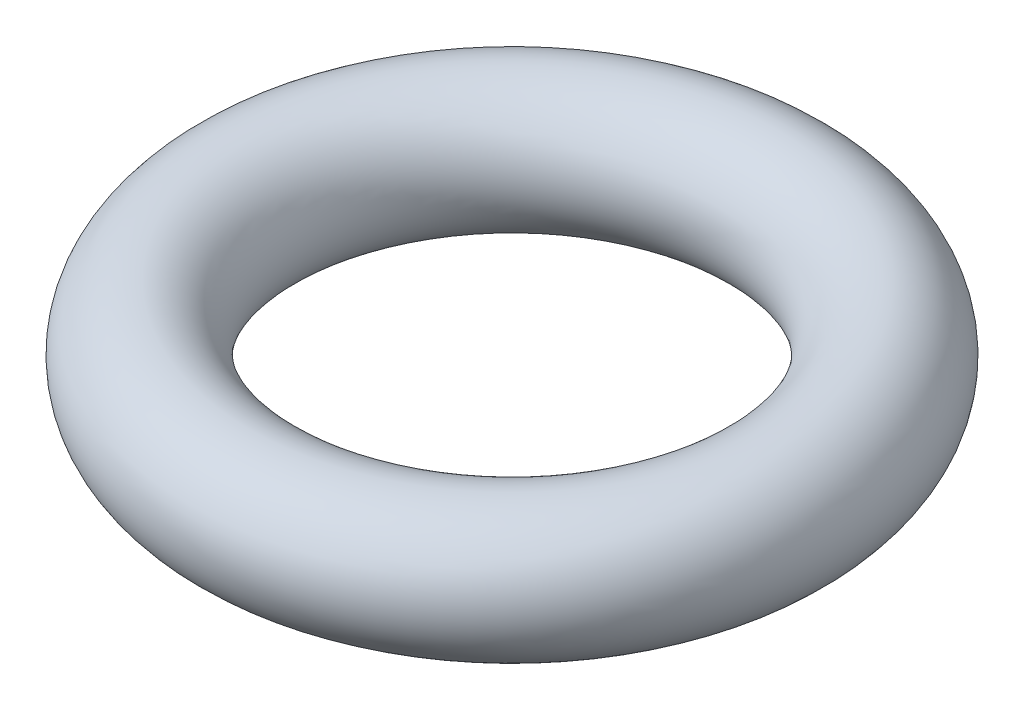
ISO-10303-21;
HEADER;
FILE_DESCRIPTION(('STEP AP214'),'2;1');
FILE_NAME('part.step','',(''),(''),'','','');
FILE_SCHEMA(('AUTOMOTIVE_DESIGN { 1 0 10303 214 1 1 1 1 }'));
ENDSEC;
DATA;
#1=APPLICATION_CONTEXT('core data for automotive mechanical design processes');
#2=APPLICATION_PROTOCOL_DEFINITION('international standard','automotive_design',2000,#1);
#3=PRODUCT_CONTEXT('',#1,'mechanical');
#4=PRODUCT('Part','Part','',(#3));
#5=PRODUCT_RELATED_PRODUCT_CATEGORY('part','',(#4));
#6=PRODUCT_DEFINITION_FORMATION('','',#4);
#7=PRODUCT_DEFINITION_CONTEXT('part definition',#1,'design');
#8=PRODUCT_DEFINITION('design','',#6,#7);
#9=PRODUCT_DEFINITION_SHAPE('','',#8);
#10=(LENGTH_UNIT() NAMED_UNIT(*) SI_UNIT(.MILLI.,.METRE.));
#11=(NAMED_UNIT(*) PLANE_ANGLE_UNIT() SI_UNIT($,.RADIAN.));
#12=(NAMED_UNIT(*) SI_UNIT($,.STERADIAN.) SOLID_ANGLE_UNIT());
#13=UNCERTAINTY_MEASURE_WITH_UNIT(LENGTH_MEASURE(1.E-05),#10,'distance_accuracy_value','');
#14=(GEOMETRIC_REPRESENTATION_CONTEXT(3) GLOBAL_UNCERTAINTY_ASSIGNED_CONTEXT((#13)) GLOBAL_UNIT_ASSIGNED_CONTEXT((#10,
#11,#12)) REPRESENTATION_CONTEXT('',''));
#15=CARTESIAN_POINT('',(0.,0.,0.));
#16=DIRECTION('',(0.,0.,1.));
#17=DIRECTION('',(1.,0.,0.));
#18=AXIS2_PLACEMENT_3D('',#15,#16,#17);
#19=CARTESIAN_POINT('',(0.,0.,0.));
#20=DIRECTION('',(0.,-1.,0.));
#21=DIRECTION('',(0.,0.,-1.));
#22=AXIS2_PLACEMENT_3D('',#19,#20,#21);
#23=TOROIDAL_SURFACE('',#22,3.4,0.85);
#24=CARTESIAN_POINT('',(0.,0.,-4.25));
#25=VERTEX_POINT('',#24);
#26=VERTEX_LOOP('',#25);
#27=FACE_BOUND('',#26,.T.);
#28=ADVANCED_FACE('F27',(#27),#23,.T.);
#29=CLOSED_SHELL('',(#28));
#30=MANIFOLD_SOLID_BREP('B2',#29);
#31=ADVANCED_BREP_SHAPE_REPRESENTATION('',(#18,#30),#14);
#32=SHAPE_DEFINITION_REPRESENTATION(#9,#31);
ENDSEC;
END-ISO-10303-21;
